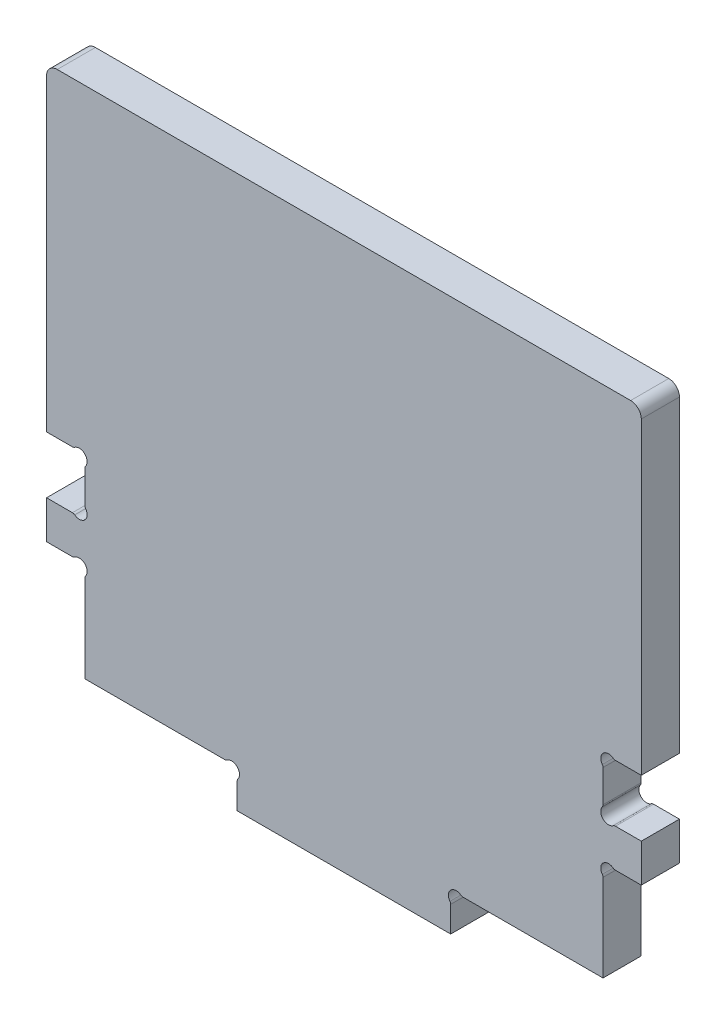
from build123d import *

# Parameters (mm, degrees)
BOSS_EXTRU_2_DEPTH = 25
CONG_1_R           = 7


with BuildPart() as part:
    # Esquisse2 → Boss.-Extru.2 (new body)
    with BuildSketch(Plane.XY):
        with BuildLine():
            Line((0, 16.868959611), (0, 0))
            Line((0, 0), (140, 0))
            Line((140, 0), (140, 16.868959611))
            ThreePointArc((140, 16.868959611), (139.873982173, 17.652674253), (139.508633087, 18.357379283))
            ThreePointArc((139.508633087, 18.357379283), (140, 25), (146.642620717, 25.491366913))
            ThreePointArc((146.642620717, 25.491366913), (147.347325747, 25.126017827), (148.131040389, 25))
            Line((148.131040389, 25), (239.9, 25))
            Line((239.9, 25), (239.9, 82.14662914))
            ThreePointArc((239.9, 82.14662914), (239.773982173, 82.930343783), (239.408633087, 83.635048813))
            ThreePointArc((239.408633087, 83.635048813), (239.9, 90.27766953), (246.542620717, 90.769036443))
            ThreePointArc((246.542620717, 90.769036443), (247.247325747, 90.403687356), (248.031040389, 90.27766953))
            Line((248.031040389, 90.27766953), (265, 90.27766953))
            Line((265, 90.27766953), (265, 115.27766953))
            Line((265, 115.27766953), (248.031040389, 115.27766953))
            ThreePointArc((248.031040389, 115.27766953), (247.247325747, 115.151651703), (246.542620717, 114.786302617))
            ThreePointArc((246.542620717, 114.786302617), (239.9, 115.27766953), (239.408633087, 121.920290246))
            ThreePointArc((239.408633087, 121.920290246), (239.773982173, 122.624995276), (239.9, 123.408709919))
            Line((239.9, 123.408709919), (239.9, 144.52429867))
            ThreePointArc((239.9, 144.52429867), (239.773982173, 145.308013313), (239.408633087, 146.012718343))
            ThreePointArc((239.408633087, 146.012718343), (239.9, 152.655339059), (246.542620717, 153.146705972))
            ThreePointArc((246.542620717, 153.146705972), (247.247325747, 152.781356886), (248.031040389, 152.655339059))
            Line((248.031040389, 152.655339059), (265, 152.655339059))
            Line((265, 152.655339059), (265, 362))
            Line((265, 362), (-125, 362))
            Line((-125, 362), (-125, 152.655339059))
            Line((-125, 152.655339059), (-108.031040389, 152.655339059))
            ThreePointArc((-108.031040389, 152.655339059), (-107.247325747, 152.781356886), (-106.542620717, 153.146705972))
            ThreePointArc((-106.542620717, 153.146705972), (-99.9, 152.655339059), (-99.408633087, 146.012718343))
            ThreePointArc((-99.408633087, 146.012718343), (-99.773982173, 145.308013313), (-99.9, 144.52429867))
            Line((-99.9, 144.52429867), (-99.9, 123.408709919))
            ThreePointArc((-99.9, 123.408709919), (-99.773982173, 122.624995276), (-99.408633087, 121.920290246))
            ThreePointArc((-99.408633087, 121.920290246), (-99.9, 115.27766953), (-106.542620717, 114.786302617))
            ThreePointArc((-106.542620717, 114.786302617), (-107.247325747, 115.151651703), (-108.031040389, 115.27766953))
            Line((-108.031040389, 115.27766953), (-125, 115.27766953))
            Line((-125, 115.27766953), (-125, 90.27766953))
            Line((-125, 90.27766953), (-108.031040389, 90.27766953))
            ThreePointArc((-108.031040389, 90.27766953), (-107.247325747, 90.403687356), (-106.542620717, 90.769036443))
            ThreePointArc((-106.542620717, 90.769036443), (-99.9, 90.27766953), (-99.408633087, 83.635048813))
            ThreePointArc((-99.408633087, 83.635048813), (-99.773982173, 82.930343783), (-99.9, 82.14662914))
            Line((-99.9, 82.14662914), (-99.9, 25))
            Line((-99.9, 25), (-8.131040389, 25))
            ThreePointArc((-8.131040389, 25), (-7.347325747, 25.126017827), (-6.642620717, 25.491366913))
            ThreePointArc((-6.642620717, 25.491366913), (0, 25), (0.491366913, 18.357379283))
            ThreePointArc((0.491366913, 18.357379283), (0.126017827, 17.652674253), (0, 16.868959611))
        make_face()
    extrude(amount=BOSS_EXTRU_2_DEPTH)

    # Cong_1
    cong_1_edges = [part.edges().sort_by_distance(p)[0] for p in [
        (-125, 362, 12.5),
        (265, 362, 12.5),
    ]]
    fillet(cong_1_edges, radius=CONG_1_R)


solid = part.part
